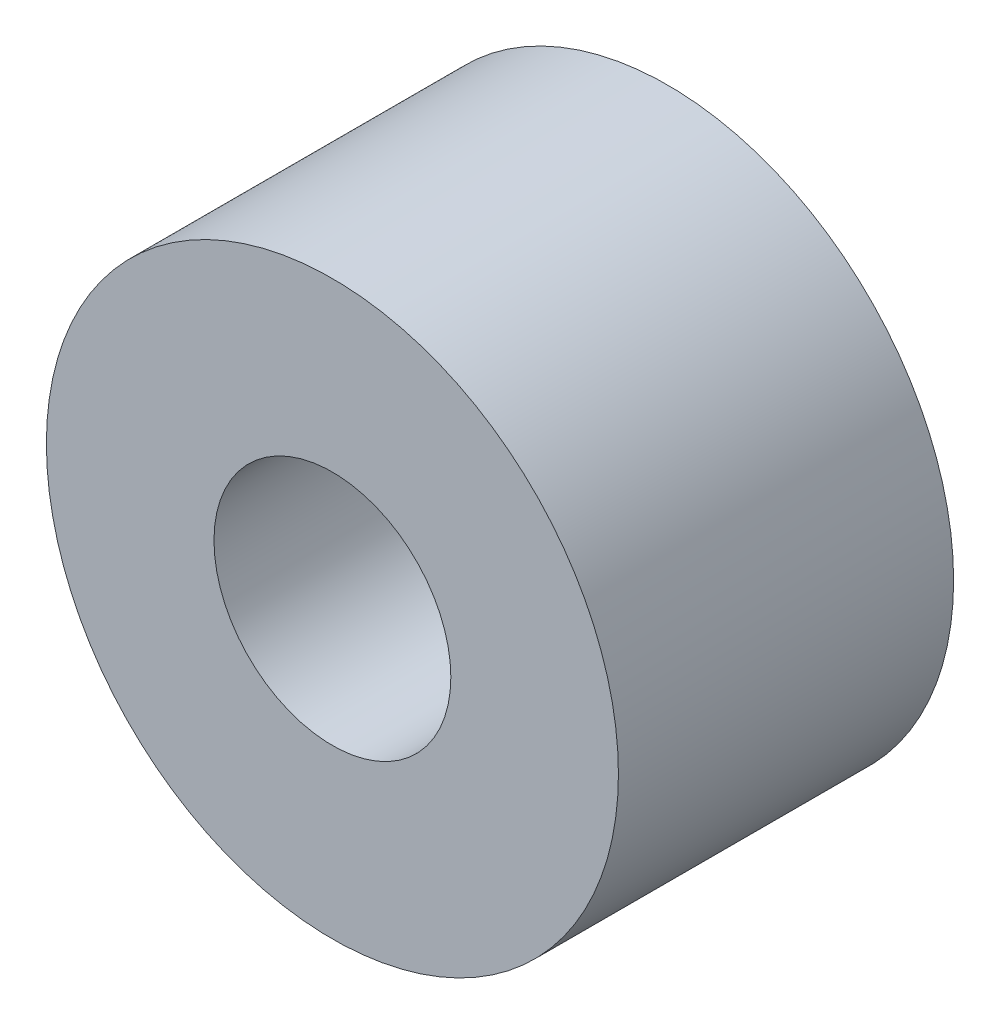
from build123d import *

# Parameters (mm, degrees)
SKETCH1_R           = 8.128
SKETCH1_R_2         = 3.3655
BOSS_EXTRUDE1_DEPTH = 9.525


with BuildPart() as part:
    # Sketch1 → Boss-Extrude1 (new body)
    with BuildSketch(Plane.XY):
        with Locations(Location((-23.739599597, 12.742542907, 0), (0, 0, 180))):
            Circle(SKETCH1_R)
        with Locations(Location((-23.739599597, 12.742542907, 0), (0, 0, 180))):
            Circle(SKETCH1_R_2, mode=Mode.SUBTRACT)
    extrude(amount=BOSS_EXTRUDE1_DEPTH)


solid = part.part
